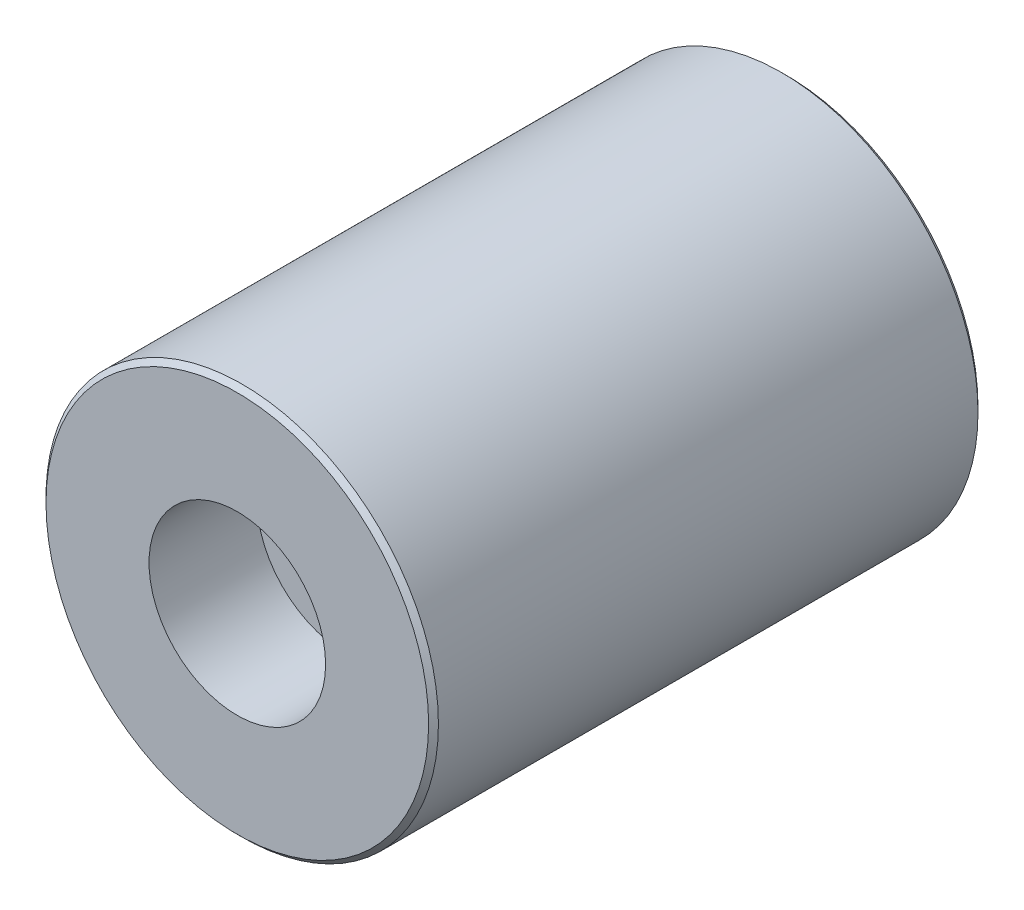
from build123d import *


with BuildPart() as part:
    # Sketch1 → Revolve1 (revolve)
    with BuildSketch(Plane(origin=(0, 0, 0), x_dir=(0, 0, -1), z_dir=(1, 0, 0)), mode=Mode.PRIVATE) as revolve1_sk:
        Polygon((0, 9), (0, 19.5), (0.5, 20), (55.5, 20), (56, 19.5), (56, 5.5), (11, 5.5), (11, 9), align=None)
    revolve(revolve1_sk.sketch.rotate(Axis((0, 0, 0), (0, 0, -1)), 90), axis=Axis((0, 0, 0), (0, 0, -1)))


solid = part.part
